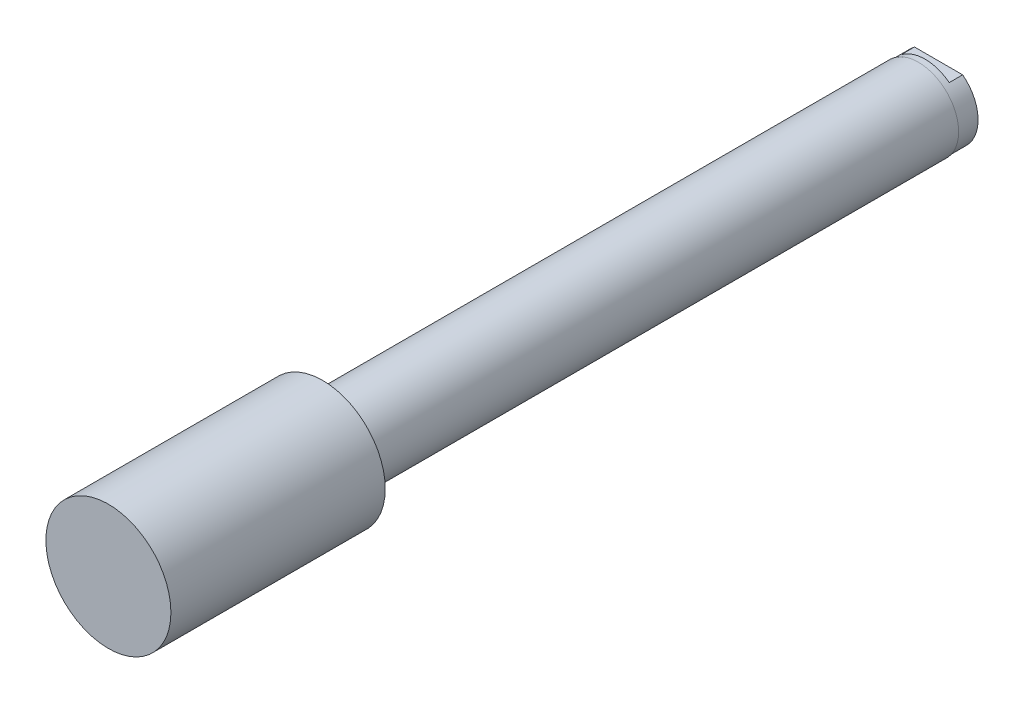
ISO-10303-21;
HEADER;
FILE_DESCRIPTION(('STEP AP214'),'2;1');
FILE_NAME('part.step','',(''),(''),'','','');
FILE_SCHEMA(('AUTOMOTIVE_DESIGN { 1 0 10303 214 1 1 1 1 }'));
ENDSEC;
DATA;
#1=APPLICATION_CONTEXT('core data for automotive mechanical design processes');
#2=APPLICATION_PROTOCOL_DEFINITION('international standard','automotive_design',2000,#1);
#3=PRODUCT_CONTEXT('',#1,'mechanical');
#4=PRODUCT('Part','Part','',(#3));
#5=PRODUCT_RELATED_PRODUCT_CATEGORY('part','',(#4));
#6=PRODUCT_DEFINITION_FORMATION('','',#4);
#7=PRODUCT_DEFINITION_CONTEXT('part definition',#1,'design');
#8=PRODUCT_DEFINITION('design','',#6,#7);
#9=PRODUCT_DEFINITION_SHAPE('','',#8);
#10=(LENGTH_UNIT() NAMED_UNIT(*) SI_UNIT(.MILLI.,.METRE.));
#11=(NAMED_UNIT(*) PLANE_ANGLE_UNIT() SI_UNIT($,.RADIAN.));
#12=(NAMED_UNIT(*) SI_UNIT($,.STERADIAN.) SOLID_ANGLE_UNIT());
#13=UNCERTAINTY_MEASURE_WITH_UNIT(LENGTH_MEASURE(1.E-05),#10,'distance_accuracy_value','');
#14=(GEOMETRIC_REPRESENTATION_CONTEXT(3) GLOBAL_UNCERTAINTY_ASSIGNED_CONTEXT((#13)) GLOBAL_UNIT_ASSIGNED_CONTEXT((#10,
#11,#12)) REPRESENTATION_CONTEXT('',''));
#15=CARTESIAN_POINT('',(0.,0.,0.));
#16=DIRECTION('',(0.,0.,1.));
#17=DIRECTION('',(1.,0.,0.));
#18=AXIS2_PLACEMENT_3D('',#15,#16,#17);
#19=CARTESIAN_POINT('',(0.,0.,15.4686));
#20=DIRECTION('',(0.,0.,1.));
#21=DIRECTION('',(1.,0.,0.));
#22=AXIS2_PLACEMENT_3D('',#19,#20,#21);
#23=PLANE('',#22);
#24=CARTESIAN_POINT('',(0.,0.,15.4686));
#25=DIRECTION('',(0.,0.,1.));
#26=DIRECTION('',(1.,0.,0.));
#27=AXIS2_PLACEMENT_3D('',#24,#25,#26);
#28=CIRCLE('',#27,2.7051);
#29=CARTESIAN_POINT('',(2.7051,0.,15.4686));
#30=VERTEX_POINT('',#29);
#31=EDGE_CURVE('E11',#30,#30,#28,.F.);
#32=ORIENTED_EDGE('',*,*,#31,.T.);
#33=EDGE_LOOP('',(#32));
#34=FACE_BOUND('',#33,.T.);
#35=ADVANCED_FACE('F18',(#34),#23,.F.);
#36=CARTESIAN_POINT('',(0.,0.,-3.5814));
#37=DIRECTION('',(0.,0.,-1.));
#38=DIRECTION('',(-1.,0.,0.));
#39=AXIS2_PLACEMENT_3D('',#36,#37,#38);
#40=CYLINDRICAL_SURFACE('',#39,2.7051);
#41=CARTESIAN_POINT('',(0.,0.,-3.5814));
#42=DIRECTION('',(0.,0.,-1.));
#43=DIRECTION('',(-1.,0.,0.));
#44=AXIS2_PLACEMENT_3D('',#41,#42,#43);
#45=CIRCLE('',#44,2.7051);
#46=CARTESIAN_POINT('',(-2.7051,0.,-3.5814));
#47=VERTEX_POINT('',#46);
#48=EDGE_CURVE('E90',#47,#47,#45,.T.);
#49=ORIENTED_EDGE('',*,*,#48,.T.);
#50=EDGE_LOOP('',(#49));
#51=FACE_BOUND('',#50,.T.);
#52=ORIENTED_EDGE('',*,*,#31,.F.);
#53=EDGE_LOOP('',(#52));
#54=FACE_BOUND('',#53,.T.);
#55=ADVANCED_FACE('F130',(#51,#54),#40,.F.);
#56=CARTESIAN_POINT('',(0.,0.,-3.5814));
#57=DIRECTION('',(0.,0.,1.));
#58=DIRECTION('',(1.,0.,0.));
#59=AXIS2_PLACEMENT_3D('',#56,#57,#58);
#60=PLANE('',#59);
#61=ORIENTED_EDGE('',*,*,#48,.F.);
#62=EDGE_LOOP('',(#61));
#63=FACE_BOUND('',#62,.T.);
#64=CARTESIAN_POINT('',(0.,0.,-3.5814));
#65=DIRECTION('',(0.,0.,-1.));
#66=DIRECTION('',(-1.,0.,0.));
#67=AXIS2_PLACEMENT_3D('',#64,#65,#66);
#68=CIRCLE('',#67,7.0231);
#69=CARTESIAN_POINT('',(-4.2873552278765,-5.5626,-3.5814));
#70=VERTEX_POINT('',#69);
#71=CARTESIAN_POINT('',(-4.2873552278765,5.5626,-3.5814));
#72=VERTEX_POINT('',#71);
#73=EDGE_CURVE('E27',#70,#72,#68,.T.);
#74=ORIENTED_EDGE('',*,*,#73,.T.);
#75=DIRECTION('',(-1.,0.,0.));
#76=VECTOR('',#75,1.);
#77=CARTESIAN_POINT('',(4.2873552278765,5.5626,-3.5814));
#78=LINE('',#77,#76);
#79=CARTESIAN_POINT('',(4.2873552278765,5.5626,-3.5814));
#80=VERTEX_POINT('',#79);
#81=EDGE_CURVE('E64',#80,#72,#78,.T.);
#82=ORIENTED_EDGE('',*,*,#81,.F.);
#83=CARTESIAN_POINT('',(4.2873552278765,-5.5626,-3.5814));
#84=VERTEX_POINT('',#83);
#85=EDGE_CURVE('E76',#80,#84,#68,.T.);
#86=ORIENTED_EDGE('',*,*,#85,.T.);
#87=DIRECTION('',(1.,0.,0.));
#88=VECTOR('',#87,1.);
#89=CARTESIAN_POINT('',(4.2873552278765,-5.5626,-3.5814));
#90=LINE('',#89,#88);
#91=EDGE_CURVE('E78',#70,#84,#90,.T.);
#92=ORIENTED_EDGE('',*,*,#91,.F.);
#93=EDGE_LOOP('',(#74,#82,#86,#92));
#94=FACE_BOUND('',#93,.T.);
#95=ADVANCED_FACE('F115',(#63,#94),#60,.F.);
#96=CARTESIAN_POINT('',(0.,0.,-4.57594200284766));
#97=DIRECTION('',(0.,0.,-1.));
#98=DIRECTION('',(-1.,0.,0.));
#99=AXIS2_PLACEMENT_3D('',#96,#97,#98);
#100=CYLINDRICAL_SURFACE('',#99,7.0231);
#101=CARTESIAN_POINT('',(0.,0.,-1.1938));
#102=DIRECTION('',(0.,0.,-1.));
#103=DIRECTION('',(-1.,0.,0.));
#104=AXIS2_PLACEMENT_3D('',#101,#102,#103);
#105=CIRCLE('',#104,7.0231);
#106=CARTESIAN_POINT('',(-4.2873552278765,5.5626,-1.1938));
#107=VERTEX_POINT('',#106);
#108=CARTESIAN_POINT('',(4.2873552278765,5.5626,-1.1938));
#109=VERTEX_POINT('',#108);
#110=EDGE_CURVE('E59',#107,#109,#105,.T.);
#111=ORIENTED_EDGE('',*,*,#110,.F.);
#112=DIRECTION('',(0.,0.,-1.));
#113=VECTOR('',#112,1.);
#114=CARTESIAN_POINT('',(-4.2873552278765,5.5626,-1.1938));
#115=LINE('',#114,#113);
#116=EDGE_CURVE('E70',#107,#72,#115,.T.);
#117=ORIENTED_EDGE('',*,*,#116,.T.);
#118=ORIENTED_EDGE('',*,*,#73,.F.);
#119=DIRECTION('',(0.,0.,-1.));
#120=VECTOR('',#119,1.);
#121=CARTESIAN_POINT('',(-4.2873552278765,-5.5626,-1.1938));
#122=LINE('',#121,#120);
#123=CARTESIAN_POINT('',(-4.2873552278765,-5.5626,-1.1938));
#124=VERTEX_POINT('',#123);
#125=EDGE_CURVE('E85',#124,#70,#122,.T.);
#126=ORIENTED_EDGE('',*,*,#125,.F.);
#127=CARTESIAN_POINT('',(0.,0.,-1.1938));
#128=DIRECTION('',(0.,0.,-1.));
#129=DIRECTION('',(-1.,0.,0.));
#130=AXIS2_PLACEMENT_3D('',#127,#128,#129);
#131=CIRCLE('',#130,7.0231);
#132=CARTESIAN_POINT('',(4.2873552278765,-5.5626,-1.1938));
#133=VERTEX_POINT('',#132);
#134=EDGE_CURVE('E82',#133,#124,#131,.T.);
#135=ORIENTED_EDGE('',*,*,#134,.F.);
#136=DIRECTION('',(0.,0.,-1.));
#137=VECTOR('',#136,1.);
#138=CARTESIAN_POINT('',(4.2873552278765,-5.5626,-1.1938));
#139=LINE('',#138,#137);
#140=EDGE_CURVE('E88',#133,#84,#139,.T.);
#141=ORIENTED_EDGE('',*,*,#140,.T.);
#142=ORIENTED_EDGE('',*,*,#85,.F.);
#143=DIRECTION('',(0.,0.,-1.));
#144=VECTOR('',#143,1.);
#145=CARTESIAN_POINT('',(4.2873552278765,5.5626,-1.1938));
#146=LINE('',#145,#144);
#147=EDGE_CURVE('E68',#109,#80,#146,.T.);
#148=ORIENTED_EDGE('',*,*,#147,.F.);
#149=EDGE_LOOP('',(#111,#117,#118,#126,#135,#141,#142,#148));
#150=FACE_BOUND('',#149,.T.);
#151=CARTESIAN_POINT('',(0.,0.,0.));
#152=DIRECTION('',(0.,0.,-1.));
#153=DIRECTION('',(-1.,0.,0.));
#154=AXIS2_PLACEMENT_3D('',#151,#152,#153);
#155=CIRCLE('',#154,7.0231);
#156=CARTESIAN_POINT('',(-7.0231,0.,0.));
#157=VERTEX_POINT('',#156);
#158=EDGE_CURVE('E94',#157,#157,#155,.T.);
#159=ORIENTED_EDGE('',*,*,#158,.T.);
#160=EDGE_LOOP('',(#159));
#161=FACE_BOUND('',#160,.T.);
#162=ADVANCED_FACE('F73',(#150,#161),#100,.T.);
#163=CARTESIAN_POINT('',(4.2873552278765,-5.5626,-1.1938));
#164=DIRECTION('',(0.,1.,0.));
#165=DIRECTION('',(0.,0.,-1.));
#166=AXIS2_PLACEMENT_3D('',#163,#164,#165);
#167=PLANE('',#166);
#168=ORIENTED_EDGE('',*,*,#91,.T.);
#169=ORIENTED_EDGE('',*,*,#140,.F.);
#170=DIRECTION('',(1.,0.,0.));
#171=VECTOR('',#170,1.);
#172=CARTESIAN_POINT('',(4.2873552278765,-5.5626,-1.1938));
#173=LINE('',#172,#171);
#174=EDGE_CURVE('E41',#124,#133,#173,.T.);
#175=ORIENTED_EDGE('',*,*,#174,.F.);
#176=ORIENTED_EDGE('',*,*,#125,.T.);
#177=EDGE_LOOP('',(#168,#169,#175,#176));
#178=FACE_BOUND('',#177,.T.);
#179=ADVANCED_FACE('F117',(#178),#167,.F.);
#180=CARTESIAN_POINT('',(0.,0.,-1.1938));
#181=DIRECTION('',(0.,0.,-1.));
#182=DIRECTION('',(-1.,0.,0.));
#183=AXIS2_PLACEMENT_3D('',#180,#181,#182);
#184=PLANE('',#183);
#185=ORIENTED_EDGE('',*,*,#134,.T.);
#186=ORIENTED_EDGE('',*,*,#174,.T.);
#187=EDGE_LOOP('',(#185,#186));
#188=FACE_BOUND('',#187,.T.);
#189=ADVANCED_FACE('F119',(#188),#184,.T.);
#190=CARTESIAN_POINT('',(4.2873552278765,5.5626,-1.1938));
#191=DIRECTION('',(0.,-1.,0.));
#192=DIRECTION('',(0.,0.,1.));
#193=AXIS2_PLACEMENT_3D('',#190,#191,#192);
#194=PLANE('',#193);
#195=ORIENTED_EDGE('',*,*,#81,.T.);
#196=ORIENTED_EDGE('',*,*,#116,.F.);
#197=DIRECTION('',(-1.,0.,0.));
#198=VECTOR('',#197,1.);
#199=CARTESIAN_POINT('',(4.2873552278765,5.5626,-1.1938));
#200=LINE('',#199,#198);
#201=EDGE_CURVE('E34',#109,#107,#200,.T.);
#202=ORIENTED_EDGE('',*,*,#201,.F.);
#203=ORIENTED_EDGE('',*,*,#147,.T.);
#204=EDGE_LOOP('',(#195,#196,#202,#203));
#205=FACE_BOUND('',#204,.T.);
#206=ADVANCED_FACE('F67',(#205),#194,.F.);
#207=CARTESIAN_POINT('',(0.,0.,-1.1938));
#208=DIRECTION('',(0.,0.,-1.));
#209=DIRECTION('',(-1.,0.,0.));
#210=AXIS2_PLACEMENT_3D('',#207,#208,#209);
#211=PLANE('',#210);
#212=ORIENTED_EDGE('',*,*,#110,.T.);
#213=ORIENTED_EDGE('',*,*,#201,.T.);
#214=EDGE_LOOP('',(#212,#213));
#215=FACE_BOUND('',#214,.T.);
#216=ADVANCED_FACE('F60',(#215),#211,.T.);
#217=CARTESIAN_POINT('',(0.,0.,143.9926));
#218=DIRECTION('',(0.,0.,1.));
#219=DIRECTION('',(1.,0.,0.));
#220=AXIS2_PLACEMENT_3D('',#217,#218,#219);
#221=PLANE('',#220);
#222=CARTESIAN_POINT('',(0.,0.,143.9926));
#223=DIRECTION('',(0.,0.,1.));
#224=DIRECTION('',(1.,0.,0.));
#225=AXIS2_PLACEMENT_3D('',#222,#223,#224);
#226=CIRCLE('',#225,11.1125);
#227=CARTESIAN_POINT('',(11.1125,0.,143.9926));
#228=VERTEX_POINT('',#227);
#229=EDGE_CURVE('E99',#228,#228,#226,.T.);
#230=ORIENTED_EDGE('',*,*,#229,.T.);
#231=EDGE_LOOP('',(#230));
#232=FACE_BOUND('',#231,.T.);
#233=ADVANCED_FACE('F147',(#232),#221,.T.);
#234=CARTESIAN_POINT('',(0.,0.,143.9926));
#235=DIRECTION('',(0.,0.,-1.));
#236=DIRECTION('',(-1.,0.,0.));
#237=AXIS2_PLACEMENT_3D('',#234,#235,#236);
#238=CYLINDRICAL_SURFACE('',#237,11.1125);
#239=ORIENTED_EDGE('',*,*,#229,.F.);
#240=EDGE_LOOP('',(#239));
#241=FACE_BOUND('',#240,.T.);
#242=CARTESIAN_POINT('',(0.,0.,105.8926));
#243=DIRECTION('',(0.,0.,1.));
#244=DIRECTION('',(1.,0.,0.));
#245=AXIS2_PLACEMENT_3D('',#242,#243,#244);
#246=CIRCLE('',#245,11.1125);
#247=CARTESIAN_POINT('',(11.1125,0.,105.8926));
#248=VERTEX_POINT('',#247);
#249=EDGE_CURVE('E103',#248,#248,#246,.T.);
#250=ORIENTED_EDGE('',*,*,#249,.T.);
#251=EDGE_LOOP('',(#250));
#252=FACE_BOUND('',#251,.T.);
#253=ADVANCED_FACE('F150',(#241,#252),#238,.T.);
#254=CARTESIAN_POINT('',(0.,0.,105.8926));
#255=DIRECTION('',(0.,0.,1.));
#256=DIRECTION('',(1.,0.,0.));
#257=AXIS2_PLACEMENT_3D('',#254,#255,#256);
#258=PLANE('',#257);
#259=CARTESIAN_POINT('',(0.,0.,105.8926));
#260=DIRECTION('',(0.,0.,1.));
#261=DIRECTION('',(1.,0.,0.));
#262=AXIS2_PLACEMENT_3D('',#259,#260,#261);
#263=CIRCLE('',#262,7.1501);
#264=CARTESIAN_POINT('',(7.15009999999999,0.,105.8926));
#265=VERTEX_POINT('',#264);
#266=EDGE_CURVE('E22',#265,#265,#263,.T.);
#267=ORIENTED_EDGE('',*,*,#266,.T.);
#268=EDGE_LOOP('',(#267));
#269=FACE_BOUND('',#268,.T.);
#270=ORIENTED_EDGE('',*,*,#249,.F.);
#271=EDGE_LOOP('',(#270));
#272=FACE_BOUND('',#271,.T.);
#273=ADVANCED_FACE('F152',(#269,#272),#258,.F.);
#274=CARTESIAN_POINT('',(0.,0.,33.9833016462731));
#275=DIRECTION('',(0.,0.,1.));
#276=DIRECTION('',(1.,0.,0.));
#277=AXIS2_PLACEMENT_3D('',#274,#275,#276);
#278=CYLINDRICAL_SURFACE('',#277,7.1501);
#279=CARTESIAN_POINT('',(0.,0.,0.));
#280=DIRECTION('',(0.,0.,1.));
#281=DIRECTION('',(1.,0.,0.));
#282=AXIS2_PLACEMENT_3D('',#279,#280,#281);
#283=CIRCLE('',#282,7.1501);
#284=CARTESIAN_POINT('',(7.1501,0.,0.));
#285=VERTEX_POINT('',#284);
#286=EDGE_CURVE('E102',#285,#285,#283,.T.);
#287=ORIENTED_EDGE('',*,*,#286,.T.);
#288=EDGE_LOOP('',(#287));
#289=FACE_BOUND('',#288,.T.);
#290=ORIENTED_EDGE('',*,*,#266,.F.);
#291=EDGE_LOOP('',(#290));
#292=FACE_BOUND('',#291,.T.);
#293=ADVANCED_FACE('F155',(#289,#292),#278,.T.);
#294=CARTESIAN_POINT('',(0.,7.1501,0.));
#295=DIRECTION('',(0.,0.,-1.));
#296=DIRECTION('',(-1.,0.,0.));
#297=AXIS2_PLACEMENT_3D('',#294,#295,#296);
#298=PLANE('',#297);
#299=ORIENTED_EDGE('',*,*,#286,.F.);
#300=EDGE_LOOP('',(#299));
#301=FACE_BOUND('',#300,.T.);
#302=ORIENTED_EDGE('',*,*,#158,.F.);
#303=EDGE_LOOP('',(#302));
#304=FACE_BOUND('',#303,.T.);
#305=ADVANCED_FACE('F20',(#301,#304),#298,.T.);
#306=CLOSED_SHELL('',(#35,#55,#95,#162,#179,#189,#206,#216,#233,#253,#273,#293,#305));
#307=MANIFOLD_SOLID_BREP('B1',#306);
#308=ADVANCED_BREP_SHAPE_REPRESENTATION('',(#18,#307),#14);
#309=SHAPE_DEFINITION_REPRESENTATION(#9,#308);
ENDSEC;
END-ISO-10303-21;
